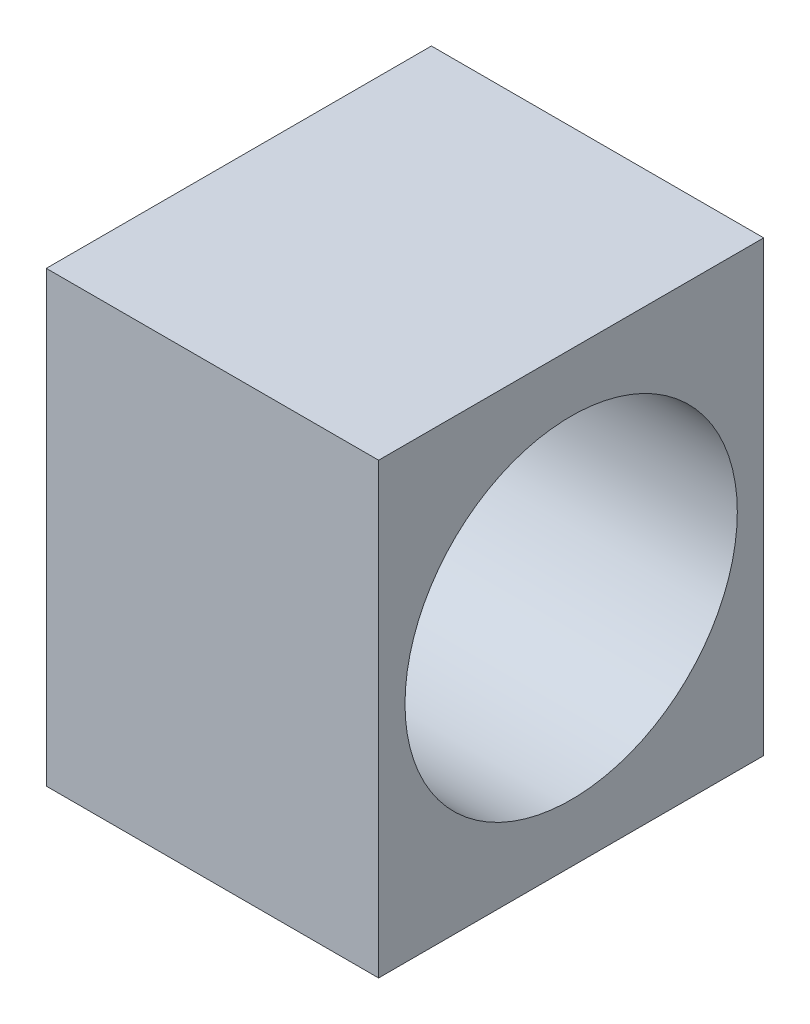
from build123d import *

# Parameters (mm, degrees)
SKETCH1_W           = 35
SKETCH1_H           = 47.229225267
BOSS_EXTRUDE1_DEPTH = 40.560662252
SKETCH2_R           = 17.5
CUT_EXTRUDE1_DEPTH  = 41.6


with BuildPart() as part:
    # Sketch1 → Boss-Extrude1 (new body)
    with BuildSketch(Plane.XY):
        with Locations((-10.135966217, 185.139544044)):
            Rectangle(SKETCH1_W, SKETCH1_H)
    extrude(amount=BOSS_EXTRUDE1_DEPTH)

    # Sketch2 → Cut-Extrude1 (cut)
    with BuildSketch(Plane(origin=(7.364033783, 0, 0), x_dir=(0, 0, -1), z_dir=(1, 0, 0))):
        with Locations((-20.280331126, 185.139544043)):
            Circle(SKETCH2_R)
    extrude(amount=-CUT_EXTRUDE1_DEPTH, mode=Mode.SUBTRACT)


solid = part.part
